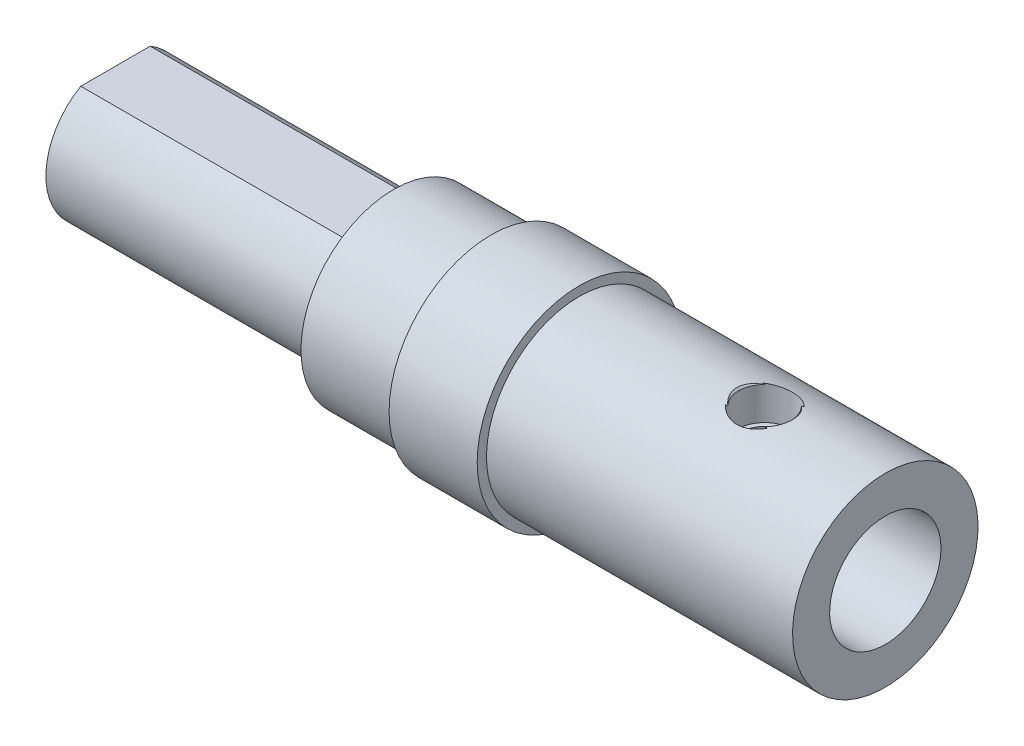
ISO-10303-21;
HEADER;
FILE_DESCRIPTION(('STEP AP214'),'2;1');
FILE_NAME('part.step','',(''),(''),'','','');
FILE_SCHEMA(('AUTOMOTIVE_DESIGN { 1 0 10303 214 1 1 1 1 }'));
ENDSEC;
DATA;
#1=APPLICATION_CONTEXT('core data for automotive mechanical design processes');
#2=APPLICATION_PROTOCOL_DEFINITION('international standard','automotive_design',2000,#1);
#3=PRODUCT_CONTEXT('',#1,'mechanical');
#4=PRODUCT('Part','Part','',(#3));
#5=PRODUCT_RELATED_PRODUCT_CATEGORY('part','',(#4));
#6=PRODUCT_DEFINITION_FORMATION('','',#4);
#7=PRODUCT_DEFINITION_CONTEXT('part definition',#1,'design');
#8=PRODUCT_DEFINITION('design','',#6,#7);
#9=PRODUCT_DEFINITION_SHAPE('','',#8);
#10=(LENGTH_UNIT() NAMED_UNIT(*) SI_UNIT(.MILLI.,.METRE.));
#11=(NAMED_UNIT(*) PLANE_ANGLE_UNIT() SI_UNIT($,.RADIAN.));
#12=(NAMED_UNIT(*) SI_UNIT($,.STERADIAN.) SOLID_ANGLE_UNIT());
#13=UNCERTAINTY_MEASURE_WITH_UNIT(LENGTH_MEASURE(1.E-05),#10,'distance_accuracy_value','');
#14=(GEOMETRIC_REPRESENTATION_CONTEXT(3) GLOBAL_UNCERTAINTY_ASSIGNED_CONTEXT((#13)) GLOBAL_UNIT_ASSIGNED_CONTEXT((#10,
#11,#12)) REPRESENTATION_CONTEXT('',''));
#15=CARTESIAN_POINT('',(0.,0.,0.));
#16=DIRECTION('',(0.,0.,1.));
#17=DIRECTION('',(1.,0.,0.));
#18=AXIS2_PLACEMENT_3D('',#15,#16,#17);
#19=CARTESIAN_POINT('',(-2.,0.,0.));
#20=DIRECTION('',(1.,0.,0.));
#21=DIRECTION('',(0.,1.,0.));
#22=AXIS2_PLACEMENT_3D('',#19,#20,#21);
#23=CYLINDRICAL_SURFACE('',#22,10.);
#24=CARTESIAN_POINT('',(-35.,0.,0.));
#25=DIRECTION('',(1.,0.,0.));
#26=DIRECTION('',(0.,1.,0.));
#27=AXIS2_PLACEMENT_3D('',#24,#25,#26);
#28=CIRCLE('',#27,10.);
#29=CARTESIAN_POINT('',(-35.,10.,0.));
#30=VERTEX_POINT('',#29);
#31=EDGE_CURVE('E233',#30,#30,#28,.T.);
#32=ORIENTED_EDGE('',*,*,#31,.T.);
#33=EDGE_LOOP('',(#32));
#34=FACE_BOUND('',#33,.T.);
#35=CARTESIAN_POINT('',(-2.,0.,0.));
#36=DIRECTION('',(1.,0.,0.));
#37=DIRECTION('',(0.,1.,0.));
#38=AXIS2_PLACEMENT_3D('',#35,#36,#37);
#39=CIRCLE('',#38,10.);
#40=CARTESIAN_POINT('',(-2.,10.,0.));
#41=VERTEX_POINT('',#40);
#42=EDGE_CURVE('E236',#41,#41,#39,.T.);
#43=ORIENTED_EDGE('',*,*,#42,.F.);
#44=EDGE_LOOP('',(#43));
#45=FACE_BOUND('',#44,.T.);
#46=CARTESIAN_POINT('',(-17.2449944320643,9.8,-1.98997487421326));
#47=CARTESIAN_POINT('',(-17.1890903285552,9.78719524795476,-2.05303840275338));
#48=CARTESIAN_POINT('',(-17.1305746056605,9.77424231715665,-2.11370133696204));
#49=CARTESIAN_POINT('',(-17.0086413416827,9.74838836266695,-2.22990216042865));
#50=CARTESIAN_POINT('',(-16.945223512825,9.73548734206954,-2.28543974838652));
#51=CARTESIAN_POINT('',(-16.7480910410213,9.69738336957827,-2.44388268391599));
#52=CARTESIAN_POINT('',(-16.6075132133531,9.67278327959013,-2.5386004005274));
#53=CARTESIAN_POINT('',(-16.3117544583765,9.62804892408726,-2.7033340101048));
#54=CARTESIAN_POINT('',(-16.1565568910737,9.60791983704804,-2.77332131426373));
#55=CARTESIAN_POINT('',(-15.8359678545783,9.5746283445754,-2.88617028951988));
#56=CARTESIAN_POINT('',(-15.670585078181,9.56146008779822,-2.92905474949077));
#57=CARTESIAN_POINT('',(-15.339140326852,9.54402403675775,-2.98537475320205));
#58=CARTESIAN_POINT('',(-15.1732235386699,9.53952023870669,-2.99959168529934));
#59=CARTESIAN_POINT('',(-14.8413282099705,9.53926933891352,-3.00039066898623));
#60=CARTESIAN_POINT('',(-14.6753496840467,9.54352080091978,-2.9869772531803));
#61=CARTESIAN_POINT('',(-14.3530324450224,9.55998731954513,-2.9338317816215));
#62=CARTESIAN_POINT('',(-14.1965537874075,9.5719705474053,-2.89486536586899));
#63=CARTESIAN_POINT('',(-13.8922307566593,9.6023024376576,-2.79259939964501));
#64=CARTESIAN_POINT('',(-13.744393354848,9.62065615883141,-2.72928050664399));
#65=CARTESIAN_POINT('',(-13.5227857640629,9.65276306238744,-2.61267258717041));
#66=CARTESIAN_POINT('',(-13.4447104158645,9.66505710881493,-2.56695208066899));
#67=CARTESIAN_POINT('',(-13.2930787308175,9.69061440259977,-2.46871871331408));
#68=CARTESIAN_POINT('',(-13.2195231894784,9.70387781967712,-2.41620466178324));
#69=CARTESIAN_POINT('',(-13.0775019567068,9.73093688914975,-2.30480976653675));
#70=CARTESIAN_POINT('',(-13.0090369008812,9.74473260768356,-2.24592812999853));
#71=CARTESIAN_POINT('',(-12.8777056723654,9.77241079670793,-2.12226524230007));
#72=CARTESIAN_POINT('',(-12.8148383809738,9.78629324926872,-2.05748517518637));
#73=CARTESIAN_POINT('',(-12.7550055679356,9.8,-1.98997487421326));
#74=B_SPLINE_CURVE_WITH_KNOTS('',3,(#46,#47,#48,#49,#50,#51,#52,#53,#54,#55,#56,#57,#58,#59,#60,
#61,#62,#63,#64,#65,#66,#67,#68,#69,#70,#71,#72,#73),.UNSPECIFIED.,.F.,.F.,(4,2,2,2,2,2,2,2,2,2,
2,2,2,4),(0.,0.255571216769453,0.511157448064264,1.02240131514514,1.53423427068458,
2.04563628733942,2.54289970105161,3.04008154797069,3.52300810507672,4.00631903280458,
4.27992693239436,4.55358285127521,4.82727288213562,5.10090809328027),.UNSPECIFIED.);
#75=CARTESIAN_POINT('',(-17.2449944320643,9.8,-1.98997487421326));
#76=VERTEX_POINT('',#75);
#77=CARTESIAN_POINT('',(-12.7550055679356,9.8,-1.98997487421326));
#78=VERTEX_POINT('',#77);
#79=EDGE_CURVE('E11',#76,#78,#74,.T.);
#80=ORIENTED_EDGE('',*,*,#79,.T.);
#81=DIRECTION('',(1.,0.,0.));
#82=VECTOR('',#81,1.);
#83=CARTESIAN_POINT('',(-2.,9.8,-1.98997487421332));
#84=LINE('',#83,#82);
#85=CARTESIAN_POINT('',(-13.0302284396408,9.8,-1.98997487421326));
#86=VERTEX_POINT('',#85);
#87=EDGE_CURVE('E115',#78,#86,#84,.F.);
#88=ORIENTED_EDGE('',*,*,#87,.T.);
#89=CARTESIAN_POINT('',(-17.0163543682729,9.80736414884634,-1.95335826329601));
#90=CARTESIAN_POINT('',(-17.1239567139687,9.82456137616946,-1.86700755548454));
#91=CARTESIAN_POINT('',(-17.2253948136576,9.84208715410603,-1.77308271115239));
#92=CARTESIAN_POINT('',(-17.4132848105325,9.876351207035,-1.57104477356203));
#93=CARTESIAN_POINT('',(-17.4997350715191,9.89308939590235,-1.46293013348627));
#94=CARTESIAN_POINT('',(-17.665473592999,9.92641266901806,-1.21803740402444));
#95=CARTESIAN_POINT('',(-17.7420741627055,9.94264970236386,-1.07936500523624));
#96=CARTESIAN_POINT('',(-17.8673260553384,9.96985142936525,-0.789404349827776));
#97=CARTESIAN_POINT('',(-17.9159982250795,9.98082005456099,-0.638125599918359));
#98=CARTESIAN_POINT('',(-17.9776676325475,9.99483556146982,-0.348572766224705));
#99=CARTESIAN_POINT('',(-17.9944618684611,9.99872289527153,-0.211144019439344));
#100=CARTESIAN_POINT('',(-18.0032083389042,10.0007395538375,0.0645091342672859));
#101=CARTESIAN_POINT('',(-17.9951741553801,9.998872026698,0.202733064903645));
#102=CARTESIAN_POINT('',(-17.9564001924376,9.98999302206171,0.46463474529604));
#103=CARTESIAN_POINT('',(-17.9274873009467,9.98339571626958,0.588604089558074));
#104=CARTESIAN_POINT('',(-17.8505019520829,9.96622126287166,0.830121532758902));
#105=CARTESIAN_POINT('',(-17.8024270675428,9.95564361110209,0.947668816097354));
#106=CARTESIAN_POINT('',(-17.6868024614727,9.93100911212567,1.17861150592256));
#107=CARTESIAN_POINT('',(-17.6185167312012,9.91682431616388,1.29162256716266));
#108=CARTESIAN_POINT('',(-17.4660049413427,9.88654166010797,1.50600071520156));
#109=CARTESIAN_POINT('',(-17.3817723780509,9.87044302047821,1.60736302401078));
#110=CARTESIAN_POINT('',(-17.1889042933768,9.83567709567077,1.80862416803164));
#111=CARTESIAN_POINT('',(-17.0785490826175,9.81693476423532,1.906860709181));
#112=CARTESIAN_POINT('',(-16.844339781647,9.7804668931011,2.08586371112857));
#113=CARTESIAN_POINT('',(-16.7204787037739,9.76274188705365,2.16662106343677));
#114=CARTESIAN_POINT('',(-16.4459284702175,9.72777227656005,2.31890563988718));
#115=CARTESIAN_POINT('',(-16.2938274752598,9.71087192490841,2.38797389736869));
#116=CARTESIAN_POINT('',(-15.9804005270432,9.68211223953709,2.50203276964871));
#117=CARTESIAN_POINT('',(-15.8190715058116,9.67025459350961,2.54701532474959));
#118=CARTESIAN_POINT('',(-15.479358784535,9.65220035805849,2.61464573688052));
#119=CARTESIAN_POINT('',(-15.3005820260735,9.64647109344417,2.63545911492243));
#120=CARTESIAN_POINT('',(-14.9419105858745,9.64293090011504,2.64838141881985));
#121=CARTESIAN_POINT('',(-14.7620157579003,9.64512102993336,2.64048650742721));
#122=CARTESIAN_POINT('',(-14.4029586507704,9.65726204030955,2.59573426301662));
#123=CARTESIAN_POINT('',(-14.223862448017,9.66734604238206,2.55838004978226));
#124=CARTESIAN_POINT('',(-13.8747343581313,9.69419379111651,2.45468042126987));
#125=CARTESIAN_POINT('',(-13.7047042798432,9.71095886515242,2.3883292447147));
#126=CARTESIAN_POINT('',(-13.3803098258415,9.74891957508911,2.22828551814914));
#127=CARTESIAN_POINT('',(-13.2258264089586,9.77007701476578,2.13482608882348));
#128=CARTESIAN_POINT('',(-12.9363094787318,9.81422274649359,1.92167522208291));
#129=CARTESIAN_POINT('',(-12.801273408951,9.83721079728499,1.80198723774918));
#130=CARTESIAN_POINT('',(-12.5643623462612,9.88043997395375,1.54679183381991));
#131=CARTESIAN_POINT('',(-12.4609418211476,9.90076298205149,1.4127415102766));
#132=CARTESIAN_POINT('',(-12.2821084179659,9.93737397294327,1.12661324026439));
#133=CARTESIAN_POINT('',(-12.2066562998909,9.95366759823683,0.974560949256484));
#134=CARTESIAN_POINT('',(-12.0969842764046,9.97785309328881,0.679206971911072));
#135=CARTESIAN_POINT('',(-12.0585430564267,9.98658801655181,0.537542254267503));
#136=CARTESIAN_POINT('',(-12.0088942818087,9.99792775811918,0.249305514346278));
#137=CARTESIAN_POINT('',(-11.9976622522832,10.0005380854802,0.102738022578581));
#138=CARTESIAN_POINT('',(-12.0028359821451,9.99934678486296,-0.172611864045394));
#139=CARTESIAN_POINT('',(-12.0161587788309,9.9962603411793,-0.301466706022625));
#140=CARTESIAN_POINT('',(-12.0638207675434,9.98539290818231,-0.554998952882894));
#141=CARTESIAN_POINT('',(-12.0981593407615,9.97761205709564,-0.679676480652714));
#142=CARTESIAN_POINT('',(-12.1860195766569,9.95820277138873,-0.921350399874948));
#143=CARTESIAN_POINT('',(-12.2394950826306,9.94658359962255,-1.03836447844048));
#144=CARTESIAN_POINT('',(-12.363372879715,9.92060401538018,-1.26269099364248));
#145=CARTESIAN_POINT('',(-12.4337803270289,9.90624276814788,-1.37000046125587));
#146=CARTESIAN_POINT('',(-12.5968600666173,9.87449435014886,-1.58339522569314));
#147=CARTESIAN_POINT('',(-12.6910519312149,9.85694825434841,-1.68829284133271));
#148=CARTESIAN_POINT('',(-12.8939123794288,9.82162698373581,-1.8829361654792));
#149=CARTESIAN_POINT('',(-13.0025884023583,9.80385169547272,-1.97267403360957));
#150=CARTESIAN_POINT('',(-13.2468747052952,9.76727224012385,-2.14694197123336));
#151=CARTESIAN_POINT('',(-13.3841445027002,9.74864634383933,-2.22918665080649));
#152=CARTESIAN_POINT('',(-13.6699039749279,9.7148730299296,-2.37205378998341));
#153=CARTESIAN_POINT('',(-13.8183984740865,9.69972711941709,-2.43266688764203));
#154=CARTESIAN_POINT('',(-14.137745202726,9.67316964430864,-2.53632709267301));
#155=CARTESIAN_POINT('',(-14.3093739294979,9.66225757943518,-2.5771230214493));
#156=CARTESIAN_POINT('',(-14.6572049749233,9.6476562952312,-2.6312573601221));
#157=CARTESIAN_POINT('',(-14.8334079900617,9.64396818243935,-2.64459156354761));
#158=CARTESIAN_POINT('',(-15.1916515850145,9.64424964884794,-2.64357010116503));
#159=CARTESIAN_POINT('',(-15.3736901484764,9.64847967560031,-2.62827267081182));
#160=CARTESIAN_POINT('',(-15.732598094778,9.6646002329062,-2.56835550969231));
#161=CARTESIAN_POINT('',(-15.9094657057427,9.67649335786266,-2.52372584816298));
#162=CARTESIAN_POINT('',(-16.2505142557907,9.70626702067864,-2.40664951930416));
#163=CARTESIAN_POINT('',(-16.4148347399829,9.72406415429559,-2.33458838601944));
#164=CARTESIAN_POINT('',(-16.7283014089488,9.76351577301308,-2.16365890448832));
#165=CARTESIAN_POINT('',(-16.8774630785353,9.785166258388,-2.06481829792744));
#166=CARTESIAN_POINT('',(-17.0163543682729,9.80736414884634,-1.95335826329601));
#167=B_SPLINE_CURVE_WITH_KNOTS('',3,(#89,#90,#91,#92,#93,#94,#95,#96,#97,#98,#99,#100,#101,#102,
#103,#104,#105,#106,#107,#108,#109,#110,#111,#112,#113,#114,#115,#116,#117,#118,#119,#120,#121,
#122,#123,#124,#125,#126,#127,#128,#129,#130,#131,#132,#133,#134,#135,#136,#137,#138,#139,#140,
#141,#142,#143,#144,#145,#146,#147,#148,#149,#150,#151,#152,#153,#154,#155,#156,#157,#158,#159,
#160,#161,#162,#163,#164,#165,#166),.UNSPECIFIED.,.T.,.F.,(4,2,2,2,2,2,2,2,2,2,2,2,2,2,2,2,2,2,
2,2,2,2,2,2,2,2,2,2,2,2,2,2,2,2,2,2,2,2,4),(0.,0.416664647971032,0.833374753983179,
1.30829910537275,1.78286849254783,2.19611809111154,2.6091416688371,2.98982923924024,
3.37056504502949,3.76736257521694,4.16432228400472,4.60933195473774,5.0545729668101,
5.55612279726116,6.05784035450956,6.5955629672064,7.13335745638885,7.68042192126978,
8.22759512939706,8.77019570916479,9.31272489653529,9.8213310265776,10.3292208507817,
10.7678093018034,11.2060030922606,11.5928739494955,11.9797334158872,12.3656660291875,
12.7517163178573,13.1762381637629,13.6009788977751,14.0822886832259,14.5638065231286,
15.0916528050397,15.6195799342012,16.1651776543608,16.7109601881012,17.249339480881,
17.7871631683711),.UNSPECIFIED.);
#168=CARTESIAN_POINT('',(-12.,10.,0.));
#169=VERTEX_POINT('',#168);
#170=EDGE_CURVE('E155',#169,#86,#167,.T.);
#171=ORIENTED_EDGE('',*,*,#170,.F.);
#172=CARTESIAN_POINT('',(-13.0302284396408,9.8,1.98997487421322));
#173=VERTEX_POINT('',#172);
#174=EDGE_CURVE('E62',#173,#169,#167,.T.);
#175=ORIENTED_EDGE('',*,*,#174,.F.);
#176=DIRECTION('',(1.,0.,0.));
#177=VECTOR('',#176,1.);
#178=CARTESIAN_POINT('',(-2.,9.8,1.98997487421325));
#179=LINE('',#178,#177);
#180=CARTESIAN_POINT('',(-12.7550055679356,9.8,1.98997487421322));
#181=VERTEX_POINT('',#180);
#182=EDGE_CURVE('E55',#173,#181,#179,.T.);
#183=ORIENTED_EDGE('',*,*,#182,.T.);
#184=CARTESIAN_POINT('',(-12.7550055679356,9.8,1.98997487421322));
#185=CARTESIAN_POINT('',(-12.8109096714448,9.78719524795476,2.05303840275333));
#186=CARTESIAN_POINT('',(-12.8694253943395,9.77424231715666,2.113701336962));
#187=CARTESIAN_POINT('',(-12.9913586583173,9.74838836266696,2.22990216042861));
#188=CARTESIAN_POINT('',(-13.0547764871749,9.73548734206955,2.28543974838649));
#189=CARTESIAN_POINT('',(-13.2519089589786,9.69738336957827,2.44388268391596));
#190=CARTESIAN_POINT('',(-13.392486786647,9.67278327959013,2.53860040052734));
#191=CARTESIAN_POINT('',(-13.6882455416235,9.62804892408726,2.70333401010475));
#192=CARTESIAN_POINT('',(-13.8434431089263,9.60791983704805,2.77332131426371));
#193=CARTESIAN_POINT('',(-14.1640321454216,9.5746283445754,2.88617028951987));
#194=CARTESIAN_POINT('',(-14.329414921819,9.56146008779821,2.92905474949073));
#195=CARTESIAN_POINT('',(-14.660859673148,9.54402403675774,2.98537475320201));
#196=CARTESIAN_POINT('',(-14.8267764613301,9.53952023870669,2.99959168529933));
#197=CARTESIAN_POINT('',(-15.1586717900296,9.53926933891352,3.00039066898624));
#198=CARTESIAN_POINT('',(-15.3246503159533,9.54352080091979,2.9869772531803));
#199=CARTESIAN_POINT('',(-15.6469675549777,9.55998731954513,2.9338317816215));
#200=CARTESIAN_POINT('',(-15.8034462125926,9.5719705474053,2.89486536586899));
#201=CARTESIAN_POINT('',(-16.1077692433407,9.6023024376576,2.79259939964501));
#202=CARTESIAN_POINT('',(-16.255606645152,9.62065615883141,2.72928050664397));
#203=CARTESIAN_POINT('',(-16.4772142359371,9.65276306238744,2.61267258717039));
#204=CARTESIAN_POINT('',(-16.5552895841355,9.66505710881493,2.56695208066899));
#205=CARTESIAN_POINT('',(-16.7069212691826,9.69061440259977,2.46871871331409));
#206=CARTESIAN_POINT('',(-16.7804768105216,9.70387781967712,2.41620466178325));
#207=CARTESIAN_POINT('',(-16.9224980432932,9.73093688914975,2.30480976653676));
#208=CARTESIAN_POINT('',(-16.9909630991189,9.74473260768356,2.24592812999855));
#209=CARTESIAN_POINT('',(-17.1222943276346,9.77241079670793,2.12226524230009));
#210=CARTESIAN_POINT('',(-17.1851616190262,9.78629324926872,2.05748517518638));
#211=CARTESIAN_POINT('',(-17.2449944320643,9.8,1.98997487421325));
#212=B_SPLINE_CURVE_WITH_KNOTS('',3,(#184,#185,#186,#187,#188,#189,#190,#191,#192,#193,#194,
#195,#196,#197,#198,#199,#200,#201,#202,#203,#204,#205,#206,#207,#208,#209,#210,#211),
.UNSPECIFIED.,.F.,.F.,(4,2,2,2,2,2,2,2,2,2,2,2,2,4),(0.,0.255571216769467,0.51115744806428,
1.02240131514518,1.53423427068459,2.04563628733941,2.54289970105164,3.04008154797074,
3.52300810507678,4.00631903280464,4.27992693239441,4.55358285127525,4.82727288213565,
5.10090809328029),.UNSPECIFIED.);
#213=CARTESIAN_POINT('',(-17.2449944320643,9.8,1.98997487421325));
#214=VERTEX_POINT('',#213);
#215=EDGE_CURVE('E48',#181,#214,#212,.T.);
#216=ORIENTED_EDGE('',*,*,#215,.T.);
#217=CARTESIAN_POINT('',(-16.9697715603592,9.8,1.98997487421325));
#218=VERTEX_POINT('',#217);
#219=EDGE_CURVE('E120',#214,#218,#179,.T.);
#220=ORIENTED_EDGE('',*,*,#219,.T.);
#221=CARTESIAN_POINT('',(-18.,10.,0.));
#222=VERTEX_POINT('',#221);
#223=EDGE_CURVE('E161',#222,#218,#167,.T.);
#224=ORIENTED_EDGE('',*,*,#223,.F.);
#225=CARTESIAN_POINT('',(-16.9697715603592,9.8,-1.98997487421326));
#226=VERTEX_POINT('',#225);
#227=EDGE_CURVE('E160',#226,#222,#167,.T.);
#228=ORIENTED_EDGE('',*,*,#227,.F.);
#229=EDGE_CURVE('E122',#226,#76,#84,.F.);
#230=ORIENTED_EDGE('',*,*,#229,.T.);
#231=EDGE_LOOP('',(#80,#88,#171,#175,#183,#216,#220,#224,#228,#230));
#232=FACE_BOUND('',#231,.T.);
#233=ADVANCED_FACE('F35',(#34,#45,#232),#23,.T.);
#234=CARTESIAN_POINT('',(-15.,10.,0.));
#235=DIRECTION('',(0.,1.,0.));
#236=DIRECTION('',(0.,0.,1.));
#237=AXIS2_PLACEMENT_3D('',#234,#235,#236);
#238=CONICAL_SURFACE('',#237,3.,0.785398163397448);
#239=CARTESIAN_POINT('',(-15.,9.8,0.));
#240=DIRECTION('',(0.,-1.,0.));
#241=DIRECTION('',(0.,0.,-1.));
#242=AXIS2_PLACEMENT_3D('',#239,#240,#241);
#243=CIRCLE('',#242,2.79999999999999);
#244=EDGE_CURVE('E112',#226,#218,#243,.F.);
#245=ORIENTED_EDGE('',*,*,#244,.F.);
#246=ORIENTED_EDGE('',*,*,#227,.T.);
#247=ORIENTED_EDGE('',*,*,#223,.T.);
#248=EDGE_LOOP('',(#245,#246,#247));
#249=FACE_BOUND('',#248,.T.);
#250=ADVANCED_FACE('F148',(#249),#238,.F.);
#251=EDGE_CURVE('E164',#173,#86,#243,.F.);
#252=ORIENTED_EDGE('',*,*,#251,.F.);
#253=ORIENTED_EDGE('',*,*,#174,.T.);
#254=ORIENTED_EDGE('',*,*,#170,.T.);
#255=EDGE_LOOP('',(#252,#253,#254));
#256=FACE_BOUND('',#255,.T.);
#257=ADVANCED_FACE('F146',(#256),#238,.F.);
#258=CARTESIAN_POINT('',(-15.,10.,0.));
#259=DIRECTION('',(0.,1.,0.));
#260=DIRECTION('',(0.,0.,1.));
#261=AXIS2_PLACEMENT_3D('',#258,#259,#260);
#262=CYLINDRICAL_SURFACE('',#261,2.5);
#263=CARTESIAN_POINT('',(-17.5,6.,0.));
#264=CARTESIAN_POINT('',(-17.4999952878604,5.99999628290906,0.133903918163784));
#265=CARTESIAN_POINT('',(-17.4891786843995,5.99546656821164,0.268039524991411));
#266=CARTESIAN_POINT('',(-17.4463192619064,5.97780115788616,0.532498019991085));
#267=CARTESIAN_POINT('',(-17.4142210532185,5.9646430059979,0.662810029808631));
#268=CARTESIAN_POINT('',(-17.3301785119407,5.93112629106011,0.915376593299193));
#269=CARTESIAN_POINT('',(-17.2783014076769,5.91079213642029,1.03765681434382));
#270=CARTESIAN_POINT('',(-17.1564541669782,5.8649055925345,1.27165974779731));
#271=CARTESIAN_POINT('',(-17.0864895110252,5.83935478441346,1.38338564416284));
#272=CARTESIAN_POINT('',(-16.9267420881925,5.78415660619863,1.59889674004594));
#273=CARTESIAN_POINT('',(-16.8361973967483,5.75437507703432,1.7020825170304));
#274=CARTESIAN_POINT('',(-16.6394713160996,5.69465427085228,1.89231966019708));
#275=CARTESIAN_POINT('',(-16.5332817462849,5.66471491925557,1.97936253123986));
#276=CARTESIAN_POINT('',(-16.3019464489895,5.60642043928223,2.1390747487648));
#277=CARTESIAN_POINT('',(-16.1761251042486,5.57821573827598,2.2108261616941));
#278=CARTESIAN_POINT('',(-15.9128534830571,5.52871144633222,2.33187881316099));
#279=CARTESIAN_POINT('',(-15.7754092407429,5.507408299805,2.38119161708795));
#280=CARTESIAN_POINT('',(-15.4996926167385,5.47557110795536,2.45349196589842));
#281=CARTESIAN_POINT('',(-15.361779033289,5.46456775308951,2.47763315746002));
#282=CARTESIAN_POINT('',(-15.0834534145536,5.45322652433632,2.50250419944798));
#283=CARTESIAN_POINT('',(-14.9430427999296,5.45288276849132,2.50324696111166));
#284=CARTESIAN_POINT('',(-14.6751998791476,5.46250239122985,2.4821690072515));
#285=CARTESIAN_POINT('',(-14.5475978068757,5.47167765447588,2.46207362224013));
#286=CARTESIAN_POINT('',(-14.2977758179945,5.49796965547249,2.40278382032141));
#287=CARTESIAN_POINT('',(-14.1755569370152,5.51508791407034,2.36358574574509));
#288=CARTESIAN_POINT('',(-13.9368845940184,5.55572369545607,2.26643917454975));
#289=CARTESIAN_POINT('',(-13.8206091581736,5.57936963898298,2.20810943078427));
#290=CARTESIAN_POINT('',(-13.5990445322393,5.63036662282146,2.07462485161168));
#291=CARTESIAN_POINT('',(-13.4937596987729,5.65771912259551,1.99946338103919));
#292=CARTESIAN_POINT('',(-13.2878000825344,5.71585953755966,1.8269919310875));
#293=CARTESIAN_POINT('',(-13.1882668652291,5.74674242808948,1.72834696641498));
#294=CARTESIAN_POINT('',(-13.0067729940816,5.80651346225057,1.51545918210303));
#295=CARTESIAN_POINT('',(-12.9248164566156,5.83540113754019,1.40121271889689));
#296=CARTESIAN_POINT('',(-12.7791283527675,5.88876567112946,1.1568958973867));
#297=CARTESIAN_POINT('',(-12.7158611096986,5.91312533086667,1.02652116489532));
#298=CARTESIAN_POINT('',(-12.6125577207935,5.95378962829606,0.755704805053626));
#299=CARTESIAN_POINT('',(-12.5725087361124,5.970098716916,0.615268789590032));
#300=CARTESIAN_POINT('',(-12.5191680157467,5.99199282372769,0.337856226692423));
#301=CARTESIAN_POINT('',(-12.5043442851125,5.99819082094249,0.20122257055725));
#302=CARTESIAN_POINT('',(-12.4973075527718,6.00112100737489,-0.0727093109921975));
#303=CARTESIAN_POINT('',(-12.505088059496,5.99785591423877,-0.210007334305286));
#304=CARTESIAN_POINT('',(-12.5419421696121,5.98262435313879,-0.474196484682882));
#305=CARTESIAN_POINT('',(-12.5699399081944,5.97109774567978,-0.601265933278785));
#306=CARTESIAN_POINT('',(-12.6449363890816,5.94097213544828,-0.848765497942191));
#307=CARTESIAN_POINT('',(-12.6919375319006,5.92237223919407,-0.969194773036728));
#308=CARTESIAN_POINT('',(-12.8051419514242,5.87916541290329,-1.2042179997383));
#309=CARTESIAN_POINT('',(-12.8718963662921,5.8543898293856,-1.3185144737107));
#310=CARTESIAN_POINT('',(-13.0221067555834,5.80147609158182,-1.53469243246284));
#311=CARTESIAN_POINT('',(-13.1055697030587,5.77333653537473,-1.63656870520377));
#312=CARTESIAN_POINT('',(-13.2938064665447,5.71424175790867,-1.83266686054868));
#313=CARTESIAN_POINT('',(-13.3996770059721,5.68322903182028,-1.92582139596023));
#314=CARTESIAN_POINT('',(-13.6260425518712,5.62368673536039,-2.09333969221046));
#315=CARTESIAN_POINT('',(-13.746540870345,5.59515772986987,-2.16769918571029));
#316=CARTESIAN_POINT('',(-14.0012283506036,5.54362772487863,-2.29631920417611));
#317=CARTESIAN_POINT('',(-14.1355880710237,5.52071125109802,-2.3502783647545));
#318=CARTESIAN_POINT('',(-14.4127411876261,5.48416711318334,-2.43434827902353));
#319=CARTESIAN_POINT('',(-14.5555275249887,5.47053179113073,-2.46447869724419));
#320=CARTESIAN_POINT('',(-14.833637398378,5.45526329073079,-2.49808160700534));
#321=CARTESIAN_POINT('',(-14.9686893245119,5.45278701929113,-2.50342760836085));
#322=CARTESIAN_POINT('',(-15.2376857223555,5.45787706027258,-2.49231151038));
#323=CARTESIAN_POINT('',(-15.3716303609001,5.46544183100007,-2.4758527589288));
#324=CARTESIAN_POINT('',(-15.6281854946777,5.48899102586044,-2.42316809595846));
#325=CARTESIAN_POINT('',(-15.7510333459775,5.50456709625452,-2.38789807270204));
#326=CARTESIAN_POINT('',(-15.989096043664,5.54206362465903,-2.29952656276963));
#327=CARTESIAN_POINT('',(-16.104308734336,5.56398586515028,-2.24642006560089));
#328=CARTESIAN_POINT('',(-16.331391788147,5.61333908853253,-2.1202057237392));
#329=CARTESIAN_POINT('',(-16.4426446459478,5.64102204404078,-2.04608723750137));
#330=CARTESIAN_POINT('',(-16.6517202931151,5.69807379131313,-1.8813681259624));
#331=CARTESIAN_POINT('',(-16.7495384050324,5.72744316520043,-1.79076178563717));
#332=CARTESIAN_POINT('',(-16.9362973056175,5.78712781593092,-1.5878041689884));
#333=CARTESIAN_POINT('',(-17.0240726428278,5.81735619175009,-1.47434977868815));
#334=CARTESIAN_POINT('',(-17.1793991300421,5.87320303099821,-1.23319985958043));
#335=CARTESIAN_POINT('',(-17.2469410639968,5.89881939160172,-1.10549787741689));
#336=CARTESIAN_POINT('',(-17.3584188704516,5.94218308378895,-0.841465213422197));
#337=CARTESIAN_POINT('',(-17.4027264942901,5.96005349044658,-0.705312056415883));
#338=CARTESIAN_POINT('',(-17.4674156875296,5.98642234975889,-0.426816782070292));
#339=CARTESIAN_POINT('',(-17.4878721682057,5.99495014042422,-0.284495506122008));
#340=CARTESIAN_POINT('',(-17.4973238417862,5.99888566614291,-0.118052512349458));
#341=CARTESIAN_POINT('',(-17.498326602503,5.99930292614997,-0.0944569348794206));
#342=CARTESIAN_POINT('',(-17.4996650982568,5.99986042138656,-0.0472433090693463));
#343=CARTESIAN_POINT('',(-17.5000008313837,6.00000065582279,-0.0236252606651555));
#344=CARTESIAN_POINT('',(-17.5,6.,0.));
#345=B_SPLINE_CURVE_WITH_KNOTS('',3,(#263,#264,#265,#266,#267,#268,#269,#270,#271,#272,#273,
#274,#275,#276,#277,#278,#279,#280,#281,#282,#283,#284,#285,#286,#287,#288,#289,#290,#291,#292,
#293,#294,#295,#296,#297,#298,#299,#300,#301,#302,#303,#304,#305,#306,#307,#308,#309,#310,#311,
#312,#313,#314,#315,#316,#317,#318,#319,#320,#321,#322,#323,#324,#325,#326,#327,#328,#329,#330,
#331,#332,#333,#334,#335,#336,#337,#338,#339,#340,#341,#342,#343,#344),.UNSPECIFIED.,.T.,.F.,(4,
2,2,2,2,2,2,2,2,2,2,2,2,2,2,2,2,2,2,2,2,2,2,2,2,2,2,2,2,2,2,2,2,2,2,2,2,2,2,2,4),(0.,
0.401613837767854,0.804277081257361,1.20558370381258,1.60676887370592,2.02635872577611,
2.44616876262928,2.88663449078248,3.32687293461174,3.74590546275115,4.16470676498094,
4.55140314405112,4.93817359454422,5.33317426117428,5.72833091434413,6.15688282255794,
6.58553498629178,7.02408110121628,7.46238448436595,7.87296886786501,8.28343534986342,
8.67353179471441,9.06367753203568,9.46594270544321,9.86837610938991,10.2995697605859,
10.7308612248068,11.1682957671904,11.6053689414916,12.0087975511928,12.4121642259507,
12.7967529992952,13.1814498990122,13.5892778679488,13.9972474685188,14.4349307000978,
14.8728129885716,15.3034571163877,15.7327450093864,15.8036033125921,15.8744618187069),.UNSPECIFIED.);
#346=CARTESIAN_POINT('',(-17.5,6.,0.));
#347=VERTEX_POINT('',#346);
#348=EDGE_CURVE('E128',#347,#347,#345,.T.);
#349=ORIENTED_EDGE('',*,*,#348,.F.);
#350=EDGE_LOOP('',(#349));
#351=FACE_BOUND('',#350,.T.);
#352=CARTESIAN_POINT('',(-15.,6.1,0.));
#353=DIRECTION('',(0.,1.,0.));
#354=DIRECTION('',(0.,0.,1.));
#355=AXIS2_PLACEMENT_3D('',#352,#353,#354);
#356=CIRCLE('',#355,2.5);
#357=CARTESIAN_POINT('',(-15.,6.1,2.5));
#358=VERTEX_POINT('',#357);
#359=EDGE_CURVE('E116',#358,#358,#356,.T.);
#360=ORIENTED_EDGE('',*,*,#359,.T.);
#361=EDGE_LOOP('',(#360));
#362=FACE_BOUND('',#361,.T.);
#363=ADVANCED_FACE('F142',(#351,#362),#262,.F.);
#364=CARTESIAN_POINT('',(-85.,0.,0.));
#365=DIRECTION('',(-1.,0.,0.));
#366=DIRECTION('',(0.,-1.,0.));
#367=AXIS2_PLACEMENT_3D('',#364,#365,#366);
#368=PLANE('',#367);
#369=DIRECTION('',(0.,0.,1.));
#370=VECTOR('',#369,1.);
#371=CARTESIAN_POINT('',(-85.,6.49999999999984,-10.9999999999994));
#372=LINE('',#371,#370);
#373=CARTESIAN_POINT('',(-85.,6.49999999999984,-3.74165738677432));
#374=VERTEX_POINT('',#373);
#375=CARTESIAN_POINT('',(-85.,6.49999999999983,3.74165738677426));
#376=VERTEX_POINT('',#375);
#377=EDGE_CURVE('E131',#374,#376,#372,.T.);
#378=ORIENTED_EDGE('',*,*,#377,.F.);
#379=CARTESIAN_POINT('',(-85.,0.,0.));
#380=DIRECTION('',(1.,0.,0.));
#381=DIRECTION('',(0.,1.,0.));
#382=AXIS2_PLACEMENT_3D('',#379,#380,#381);
#383=CIRCLE('',#382,7.50000000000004);
#384=EDGE_CURVE('E211',#376,#374,#383,.T.);
#385=ORIENTED_EDGE('',*,*,#384,.F.);
#386=EDGE_LOOP('',(#378,#385));
#387=FACE_BOUND('',#386,.T.);
#388=ADVANCED_FACE('F37',(#387),#368,.T.);
#389=CARTESIAN_POINT('',(-2.,0.,0.));
#390=DIRECTION('',(1.,0.,0.));
#391=DIRECTION('',(0.,1.,0.));
#392=AXIS2_PLACEMENT_3D('',#389,#390,#391);
#393=CYLINDRICAL_SURFACE('',#392,7.50000000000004);
#394=DIRECTION('',(1.,0.,0.));
#395=VECTOR('',#394,1.);
#396=CARTESIAN_POINT('',(-2.,6.49999999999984,-3.74165738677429));
#397=LINE('',#396,#395);
#398=CARTESIAN_POINT('',(-54.9999999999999,6.49999999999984,-3.74165738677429));
#399=VERTEX_POINT('',#398);
#400=EDGE_CURVE('E206',#399,#374,#397,.F.);
#401=ORIENTED_EDGE('',*,*,#400,.F.);
#402=CARTESIAN_POINT('',(-55.,0.,0.));
#403=DIRECTION('',(1.,0.,0.));
#404=DIRECTION('',(0.,1.,0.));
#405=AXIS2_PLACEMENT_3D('',#402,#403,#404);
#406=CIRCLE('',#405,7.50000000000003);
#407=CARTESIAN_POINT('',(-55.,6.49999999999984,3.74165738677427));
#408=VERTEX_POINT('',#407);
#409=EDGE_CURVE('E209',#408,#399,#406,.T.);
#410=ORIENTED_EDGE('',*,*,#409,.F.);
#411=DIRECTION('',(1.,0.,0.));
#412=VECTOR('',#411,1.);
#413=CARTESIAN_POINT('',(-2.,6.49999999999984,3.74165738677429));
#414=LINE('',#413,#412);
#415=EDGE_CURVE('E215',#376,#408,#414,.T.);
#416=ORIENTED_EDGE('',*,*,#415,.F.);
#417=ORIENTED_EDGE('',*,*,#384,.T.);
#418=EDGE_LOOP('',(#401,#410,#416,#417));
#419=FACE_BOUND('',#418,.T.);
#420=ADVANCED_FACE('F195',(#419),#393,.T.);
#421=CARTESIAN_POINT('',(-55.,7.50000000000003,0.));
#422=DIRECTION('',(-1.,0.,0.));
#423=DIRECTION('',(0.,-1.,0.));
#424=AXIS2_PLACEMENT_3D('',#421,#422,#423);
#425=PLANE('',#424);
#426=DIRECTION('',(0.,0.,1.));
#427=VECTOR('',#426,1.);
#428=CARTESIAN_POINT('',(-54.9999999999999,6.49999999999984,-10.9999999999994));
#429=LINE('',#428,#427);
#430=EDGE_CURVE('E138',#399,#408,#429,.T.);
#431=ORIENTED_EDGE('',*,*,#430,.T.);
#432=ORIENTED_EDGE('',*,*,#409,.T.);
#433=EDGE_LOOP('',(#431,#432));
#434=FACE_BOUND('',#433,.T.);
#435=CARTESIAN_POINT('',(-55.,0.,0.));
#436=DIRECTION('',(1.,0.,0.));
#437=DIRECTION('',(0.,1.,0.));
#438=AXIS2_PLACEMENT_3D('',#435,#436,#437);
#439=CIRCLE('',#438,9.99999999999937);
#440=CARTESIAN_POINT('',(-55.,9.99999999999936,0.));
#441=VERTEX_POINT('',#440);
#442=EDGE_CURVE('E219',#441,#441,#439,.T.);
#443=ORIENTED_EDGE('',*,*,#442,.F.);
#444=EDGE_LOOP('',(#443));
#445=FACE_BOUND('',#444,.T.);
#446=ADVANCED_FACE('F192',(#434,#445),#425,.T.);
#447=CARTESIAN_POINT('',(-2.,0.,0.));
#448=DIRECTION('',(1.,0.,0.));
#449=DIRECTION('',(0.,1.,0.));
#450=AXIS2_PLACEMENT_3D('',#447,#448,#449);
#451=CYLINDRICAL_SURFACE('',#450,9.99999999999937);
#452=ORIENTED_EDGE('',*,*,#442,.T.);
#453=EDGE_LOOP('',(#452));
#454=FACE_BOUND('',#453,.T.);
#455=CARTESIAN_POINT('',(-44.5,0.,0.));
#456=DIRECTION('',(1.,0.,0.));
#457=DIRECTION('',(0.,1.,0.));
#458=AXIS2_PLACEMENT_3D('',#455,#456,#457);
#459=CIRCLE('',#458,9.99999999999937);
#460=CARTESIAN_POINT('',(-44.5,9.99999999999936,0.));
#461=VERTEX_POINT('',#460);
#462=EDGE_CURVE('E222',#461,#461,#459,.T.);
#463=ORIENTED_EDGE('',*,*,#462,.F.);
#464=EDGE_LOOP('',(#463));
#465=FACE_BOUND('',#464,.T.);
#466=ADVANCED_FACE('F188',(#454,#465),#451,.T.);
#467=CARTESIAN_POINT('',(-44.5,9.99999999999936,0.));
#468=DIRECTION('',(-1.,0.,0.));
#469=DIRECTION('',(0.,-1.,0.));
#470=AXIS2_PLACEMENT_3D('',#467,#468,#469);
#471=PLANE('',#470);
#472=ORIENTED_EDGE('',*,*,#462,.T.);
#473=EDGE_LOOP('',(#472));
#474=FACE_BOUND('',#473,.T.);
#475=CARTESIAN_POINT('',(-44.5,0.,0.));
#476=DIRECTION('',(1.,0.,0.));
#477=DIRECTION('',(0.,1.,0.));
#478=AXIS2_PLACEMENT_3D('',#475,#476,#477);
#479=CIRCLE('',#478,10.9999999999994);
#480=CARTESIAN_POINT('',(-44.5,10.9999999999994,0.));
#481=VERTEX_POINT('',#480);
#482=EDGE_CURVE('E227',#481,#481,#479,.T.);
#483=ORIENTED_EDGE('',*,*,#482,.F.);
#484=EDGE_LOOP('',(#483));
#485=FACE_BOUND('',#484,.T.);
#486=ADVANCED_FACE('F184',(#474,#485),#471,.T.);
#487=CARTESIAN_POINT('',(-2.,0.,0.));
#488=DIRECTION('',(1.,0.,0.));
#489=DIRECTION('',(0.,1.,0.));
#490=AXIS2_PLACEMENT_3D('',#487,#488,#489);
#491=CYLINDRICAL_SURFACE('',#490,10.9999999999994);
#492=ORIENTED_EDGE('',*,*,#482,.T.);
#493=EDGE_LOOP('',(#492));
#494=FACE_BOUND('',#493,.T.);
#495=CARTESIAN_POINT('',(-35.,0.,0.));
#496=DIRECTION('',(1.,0.,0.));
#497=DIRECTION('',(0.,1.,0.));
#498=AXIS2_PLACEMENT_3D('',#495,#496,#497);
#499=CIRCLE('',#498,10.9999999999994);
#500=CARTESIAN_POINT('',(-35.,10.9999999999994,0.));
#501=VERTEX_POINT('',#500);
#502=EDGE_CURVE('E230',#501,#501,#499,.T.);
#503=ORIENTED_EDGE('',*,*,#502,.F.);
#504=EDGE_LOOP('',(#503));
#505=FACE_BOUND('',#504,.T.);
#506=ADVANCED_FACE('F180',(#494,#505),#491,.T.);
#507=CARTESIAN_POINT('',(-35.,10.9999999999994,0.));
#508=DIRECTION('',(1.,0.,0.));
#509=DIRECTION('',(0.,1.,0.));
#510=AXIS2_PLACEMENT_3D('',#507,#508,#509);
#511=PLANE('',#510);
#512=ORIENTED_EDGE('',*,*,#502,.T.);
#513=EDGE_LOOP('',(#512));
#514=FACE_BOUND('',#513,.T.);
#515=ORIENTED_EDGE('',*,*,#31,.F.);
#516=EDGE_LOOP('',(#515));
#517=FACE_BOUND('',#516,.T.);
#518=ADVANCED_FACE('F172',(#514,#517),#511,.T.);
#519=CARTESIAN_POINT('',(-2.,10.,0.));
#520=DIRECTION('',(1.,0.,0.));
#521=DIRECTION('',(0.,1.,0.));
#522=AXIS2_PLACEMENT_3D('',#519,#520,#521);
#523=PLANE('',#522);
#524=CARTESIAN_POINT('',(-2.,0.,0.));
#525=DIRECTION('',(1.,0.,0.));
#526=DIRECTION('',(0.,1.,0.));
#527=AXIS2_PLACEMENT_3D('',#524,#525,#526);
#528=CIRCLE('',#527,5.99999999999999);
#529=CARTESIAN_POINT('',(-2.,6.,0.));
#530=VERTEX_POINT('',#529);
#531=EDGE_CURVE('E162',#530,#530,#528,.T.);
#532=ORIENTED_EDGE('',*,*,#531,.F.);
#533=EDGE_LOOP('',(#532));
#534=FACE_BOUND('',#533,.T.);
#535=ORIENTED_EDGE('',*,*,#42,.T.);
#536=EDGE_LOOP('',(#535));
#537=FACE_BOUND('',#536,.T.);
#538=ADVANCED_FACE('F170',(#534,#537),#523,.T.);
#539=CARTESIAN_POINT('',(-27.,6.,0.));
#540=DIRECTION('',(-1.,0.,0.));
#541=DIRECTION('',(0.,-1.,0.));
#542=AXIS2_PLACEMENT_3D('',#539,#540,#541);
#543=PLANE('',#542);
#544=CARTESIAN_POINT('',(-27.,0.,0.));
#545=DIRECTION('',(1.,0.,0.));
#546=DIRECTION('',(0.,0.,-1.));
#547=AXIS2_PLACEMENT_3D('',#544,#545,#546);
#548=CIRCLE('',#547,4.99999999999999);
#549=CARTESIAN_POINT('',(-27.,0.,-4.99999999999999));
#550=VERTEX_POINT('',#549);
#551=EDGE_CURVE('E214',#550,#550,#548,.T.);
#552=ORIENTED_EDGE('',*,*,#551,.F.);
#553=EDGE_LOOP('',(#552));
#554=FACE_BOUND('',#553,.T.);
#555=CARTESIAN_POINT('',(-27.,0.,0.));
#556=DIRECTION('',(1.,0.,0.));
#557=DIRECTION('',(0.,1.,0.));
#558=AXIS2_PLACEMENT_3D('',#555,#556,#557);
#559=CIRCLE('',#558,5.99999999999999);
#560=CARTESIAN_POINT('',(-27.,6.,0.));
#561=VERTEX_POINT('',#560);
#562=EDGE_CURVE('E239',#561,#561,#559,.T.);
#563=ORIENTED_EDGE('',*,*,#562,.T.);
#564=EDGE_LOOP('',(#563));
#565=FACE_BOUND('',#564,.T.);
#566=ADVANCED_FACE('F259',(#554,#565),#543,.F.);
#567=CARTESIAN_POINT('',(0.,0.,0.));
#568=DIRECTION('',(1.,0.,0.));
#569=DIRECTION('',(0.,1.,0.));
#570=AXIS2_PLACEMENT_3D('',#567,#568,#569);
#571=CYLINDRICAL_SURFACE('',#570,5.99999999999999);
#572=ORIENTED_EDGE('',*,*,#348,.T.);
#573=EDGE_LOOP('',(#572));
#574=FACE_BOUND('',#573,.T.);
#575=ORIENTED_EDGE('',*,*,#531,.T.);
#576=EDGE_LOOP('',(#575));
#577=FACE_BOUND('',#576,.T.);
#578=ORIENTED_EDGE('',*,*,#562,.F.);
#579=EDGE_LOOP('',(#578));
#580=FACE_BOUND('',#579,.T.);
#581=ADVANCED_FACE('F254',(#574,#577,#580),#571,.F.);
#582=CARTESIAN_POINT('',(-27.,0.,0.));
#583=DIRECTION('',(1.,0.,0.));
#584=DIRECTION('',(0.,0.,-1.));
#585=AXIS2_PLACEMENT_3D('',#582,#583,#584);
#586=CONICAL_SURFACE('',#585,4.99999999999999,1.02974425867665);
#587=CARTESIAN_POINT('',(-30.0043030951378,0.,0.));
#588=VERTEX_POINT('',#587);
#589=VERTEX_LOOP('',#588);
#590=FACE_BOUND('',#589,.T.);
#591=ORIENTED_EDGE('',*,*,#551,.T.);
#592=EDGE_LOOP('',(#591));
#593=FACE_BOUND('',#592,.T.);
#594=ADVANCED_FACE('F247',(#590,#593),#586,.F.);
#595=CARTESIAN_POINT('',(-85.,6.49999999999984,-10.9999999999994));
#596=DIRECTION('',(0.,-1.,0.));
#597=DIRECTION('',(1.,0.,0.));
#598=AXIS2_PLACEMENT_3D('',#595,#596,#597);
#599=PLANE('',#598);
#600=ORIENTED_EDGE('',*,*,#400,.T.);
#601=ORIENTED_EDGE('',*,*,#377,.T.);
#602=ORIENTED_EDGE('',*,*,#415,.T.);
#603=ORIENTED_EDGE('',*,*,#430,.F.);
#604=EDGE_LOOP('',(#600,#601,#602,#603));
#605=FACE_BOUND('',#604,.T.);
#606=ADVANCED_FACE('F244',(#605),#599,.F.);
#607=CARTESIAN_POINT('',(-12.,9.8,0.));
#608=DIRECTION('',(0.,-1.,0.));
#609=DIRECTION('',(0.,0.,-1.));
#610=AXIS2_PLACEMENT_3D('',#607,#608,#609);
#611=PLANE('',#610);
#612=ORIENTED_EDGE('',*,*,#244,.T.);
#613=ORIENTED_EDGE('',*,*,#219,.F.);
#614=CARTESIAN_POINT('',(-15.,9.8,0.));
#615=DIRECTION('',(0.,1.,0.));
#616=DIRECTION('',(0.,0.,1.));
#617=AXIS2_PLACEMENT_3D('',#614,#615,#616);
#618=CIRCLE('',#617,3.);
#619=EDGE_CURVE('E109',#76,#214,#618,.T.);
#620=ORIENTED_EDGE('',*,*,#619,.F.);
#621=ORIENTED_EDGE('',*,*,#229,.F.);
#622=EDGE_LOOP('',(#612,#613,#620,#621));
#623=FACE_BOUND('',#622,.T.);
#624=ADVANCED_FACE('F246',(#623),#611,.T.);
#625=CARTESIAN_POINT('',(-15.,10.,0.));
#626=DIRECTION('',(0.,1.,0.));
#627=DIRECTION('',(0.,0.,1.));
#628=AXIS2_PLACEMENT_3D('',#625,#626,#627);
#629=CYLINDRICAL_SURFACE('',#628,3.);
#630=EDGE_CURVE('E107',#181,#78,#618,.T.);
#631=ORIENTED_EDGE('',*,*,#630,.T.);
#632=ORIENTED_EDGE('',*,*,#79,.F.);
#633=ORIENTED_EDGE('',*,*,#619,.T.);
#634=ORIENTED_EDGE('',*,*,#215,.F.);
#635=EDGE_LOOP('',(#631,#632,#633,#634));
#636=FACE_BOUND('',#635,.T.);
#637=CARTESIAN_POINT('',(-15.,6.1,0.));
#638=DIRECTION('',(0.,1.,0.));
#639=DIRECTION('',(0.,0.,1.));
#640=AXIS2_PLACEMENT_3D('',#637,#638,#639);
#641=CIRCLE('',#640,3.);
#642=CARTESIAN_POINT('',(-15.,6.1,3.));
#643=VERTEX_POINT('',#642);
#644=EDGE_CURVE('E118',#643,#643,#641,.T.);
#645=ORIENTED_EDGE('',*,*,#644,.F.);
#646=EDGE_LOOP('',(#645));
#647=FACE_BOUND('',#646,.T.);
#648=ADVANCED_FACE('F105',(#636,#647),#629,.F.);
#649=CARTESIAN_POINT('',(-12.,6.1,0.));
#650=DIRECTION('',(0.,1.,0.));
#651=DIRECTION('',(0.,0.,1.));
#652=AXIS2_PLACEMENT_3D('',#649,#650,#651);
#653=PLANE('',#652);
#654=ORIENTED_EDGE('',*,*,#644,.T.);
#655=EDGE_LOOP('',(#654));
#656=FACE_BOUND('',#655,.T.);
#657=ORIENTED_EDGE('',*,*,#359,.F.);
#658=EDGE_LOOP('',(#657));
#659=FACE_BOUND('',#658,.T.);
#660=ADVANCED_FACE('F353',(#656,#659),#653,.T.);
#661=ORIENTED_EDGE('',*,*,#630,.F.);
#662=ORIENTED_EDGE('',*,*,#182,.F.);
#663=ORIENTED_EDGE('',*,*,#251,.T.);
#664=ORIENTED_EDGE('',*,*,#87,.F.);
#665=EDGE_LOOP('',(#661,#662,#663,#664));
#666=FACE_BOUND('',#665,.T.);
#667=ADVANCED_FACE('F113',(#666),#611,.T.);
#668=CLOSED_SHELL('',(#233,#250,#257,#363,#388,#420,#446,#466,#486,#506,#518,#538,#566,#581,
#594,#606,#624,#648,#660,#667));
#669=MANIFOLD_SOLID_BREP('B2',#668);
#670=ADVANCED_BREP_SHAPE_REPRESENTATION('',(#18,#669),#14);
#671=SHAPE_DEFINITION_REPRESENTATION(#9,#670);
ENDSEC;
END-ISO-10303-21;
